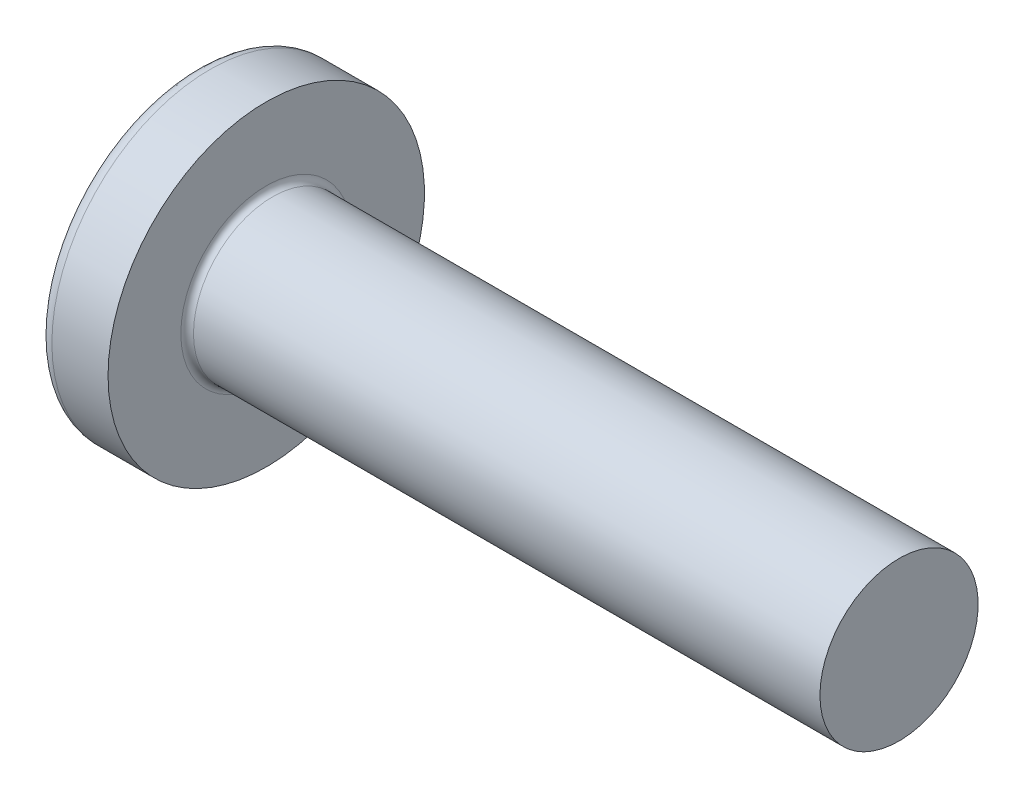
from build123d import *

# Parameters (mm, degrees)
FILLET1_R    = 0.4
RECPAT_COUNT = 2
RECPAT_ANGLE = 90


with BuildPart() as part:
    # BodySke → Base-Revolve (revolve)
    with BuildSketch(Plane.XY, mode=Mode.PRIVATE) as base_revolve_sk:
        with BuildLine():
            Line((7.5, 5), (7.5, 10))
            Line((7.5, 10), (3.950103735, 10))
            ThreePointArc((3.950103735, 10), (3.548946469, 9.905650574), (3.231897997, 9.642384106))
            ThreePointArc((3.231897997, 9.642384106), (0.82947542, 5.084799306), (0, 0))
            Line((0, 0), (47.5, 0))
            Line((47.5, 0), (47.5, 5))
            Line((47.5, 5), (7.5, 5))
        make_face()
    revolve(base_revolve_sk.sketch.rotate(Axis((3.950103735, 0, 0), (1, 0, 0)), 90), axis=Axis((3.950103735, 0, 0), (1, 0, 0)))

    # Fillet1
    fillet1_edges = [part.edges().sort_by_distance(p)[0] for p in [
        (7.5, 0, -5),
    ]]
    fillet(fillet1_edges, radius=FILLET1_R)

    # Sketch3 → Recess section 0
    with BuildSketch(Plane(origin=(0, 0, 0), x_dir=(0, 0, -1), z_dir=(1, 0, 0))):
        with BuildLine():
            Line((1.08, -4.95), (-1.08, -4.95))
            Line((-1.08, -4.95), (-1.08, 4.95))
            Line((-1.08, 4.95), (1.08, 4.95))
            Line((1.08, 4.95), (1.08, -4.95))
        make_face()
    # Sketch4 → Recess section 1
    with BuildSketch(Plane(origin=(5.69, 0, 0), x_dir=(0, 0, -1), z_dir=(1, 0, 0))):
        with BuildLine():
            Line((1.08, -2.113071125), (-1.08, -2.113071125))
            Line((-1.08, -2.113071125), (-1.08, 2.113071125))
            Line((-1.08, 2.113071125), (1.08, 2.113071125))
            Line((1.08, 2.113071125), (1.08, -2.113071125))
        make_face()
    recess = loft(mode=Mode.SUBTRACT)

    # RecPat: Recess ×2 about axis
    recpat_axis = Axis((0, 0, 0), (1, 0, 0))
    for i in range(1, RECPAT_COUNT):
        add(recess.rotate(recpat_axis, i * RECPAT_ANGLE / (RECPAT_COUNT - 1)), mode=Mode.SUBTRACT)

    # RecCorSke → RecessCore (revolve, cut)
    with BuildSketch(Plane.XY, mode=Mode.PRIVATE) as recesscore_sk:
        Polygon((0, 0), (0, 2.32838356), (5.69, 1.9305), (6.317257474, 0), align=None)
    revolve(recesscore_sk.sketch.rotate(Axis((-3.175, 0, 0), (1, 0, 0)), 346.773272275), axis=Axis((-3.175, 0, 0), (1, 0, 0)), mode=Mode.SUBTRACT)


solid = part.part
